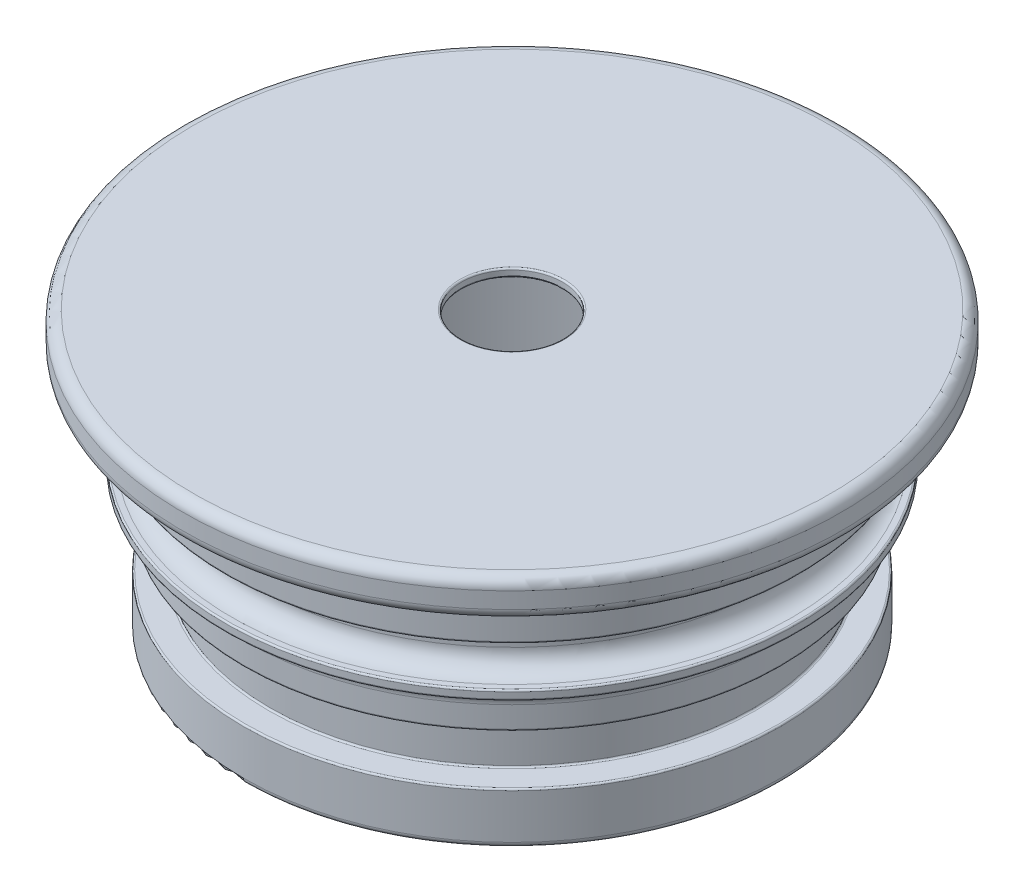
from build123d import *


with BuildPart() as part:
    # Sketch1 → Revolve1 (revolve)
    with BuildSketch(Plane.XY):
        with BuildLine():
            Line((-2.4638, 0), (-15.0495, 0))
            ThreePointArc((-15.0495, 0), (-15.408710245, -0.148789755), (-15.5575, -0.508))
            Line((-15.5575, -0.508), (-15.5575, -1.27))
            ThreePointArc((-15.5575, -1.27), (-15.408710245, -1.629210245), (-15.0495, -1.778))
            Line((-15.0495, -1.778), (-13.6144, -1.778))
            ThreePointArc((-13.6144, -1.778), (-13.560518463, -1.800318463), (-13.5382, -1.8542))
            Line((-13.5382, -1.8542), (-13.5382, -4.0132))
            ThreePointArc((-13.5382, -4.0132), (-13.515881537, -4.067081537), (-13.462, -4.0894))
            Line((-13.462, -4.0894), (-12.3952, -4.0894))
            ThreePointArc((-12.3952, -4.0894), (-12.341318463, -4.111718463), (-12.319, -4.1656))
            Line((-12.319, -4.1656), (-12.319, -5.1054))
            ThreePointArc((-12.319, -5.1054), (-12.579382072, -5.734017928), (-13.208, -5.9944))
            Line((-13.208, -5.9944), (-13.462, -5.9944))
            ThreePointArc((-13.462, -5.9944), (-13.515881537, -6.016718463), (-13.5382, -6.0706))
            Line((-13.5382, -6.0706), (-13.5382, -6.360394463))
            ThreePointArc((-13.5382, -6.360394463), (-13.515881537, -6.414275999), (-13.462, -6.436594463))
            Line((-13.462, -6.436594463), (-13.4366, -6.436594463))
            ThreePointArc((-13.4366, -6.436594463), (-12.897784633, -6.659779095), (-12.6746, -7.198594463))
            Line((-12.6746, -7.198594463), (-12.6746, -8.2042))
            ThreePointArc((-12.6746, -8.2042), (-12.652281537, -8.258081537), (-12.5984, -8.2804))
            Line((-12.5984, -8.2804), (-11.5062, -8.2804))
            ThreePointArc((-11.5062, -8.2804), (-11.452318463, -8.302718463), (-11.43, -8.3566))
            Line((-11.43, -8.3566), (-11.43, -10.5664))
            ThreePointArc((-11.43, -10.5664), (-11.452318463, -10.620281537), (-11.5062, -10.6426))
            Line((-11.5062, -10.6426), (-12.5984, -10.6426))
            ThreePointArc((-12.5984, -10.6426), (-12.652281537, -10.664918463), (-12.6746, -10.7188))
            Line((-12.6746, -10.7188), (-12.6746, -12.827))
            ThreePointArc((-12.6746, -12.827), (-12.600205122, -13.006605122), (-12.4206, -13.081))
            Line((-12.4206, -13.081), (-10.6172, -13.081))
            ThreePointArc((-10.6172, -13.081), (-10.563318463, -13.058681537), (-10.541, -13.0048))
            Line((-10.541, -13.0048), (-10.541, -2.884320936))
            ThreePointArc((-10.541, -2.884320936), (-10.243876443, -2.067980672), (-9.491533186, -1.63361509))
            Line((-9.491533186, -1.63361509), (-2.450568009, -0.392102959))
            ThreePointArc((-2.450568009, -0.392102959), (-2.405427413, -0.366041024), (-2.3876, -0.317060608))
            Line((-2.3876, -0.317060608), (-2.3876, -0.0762))
            ThreePointArc((-2.3876, -0.0762), (-2.409918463, -0.022318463), (-2.4638, 0))
        make_face()
    revolve(axis=Axis((0, 0, 0), (0, -1, 0)))


solid = part.part
